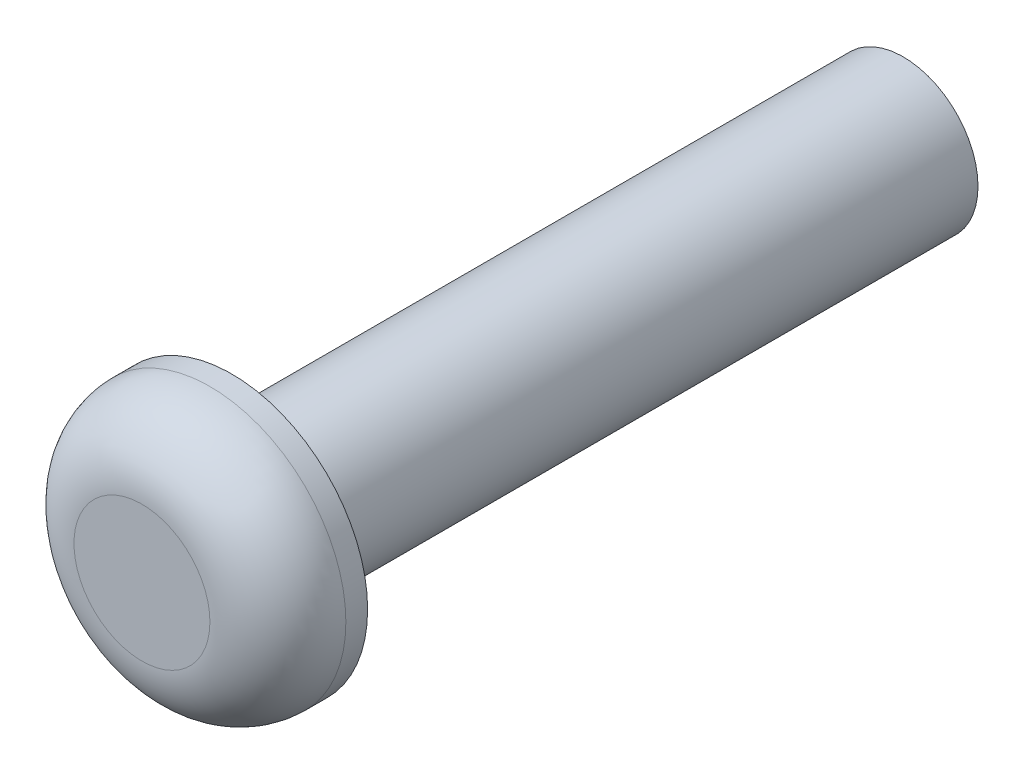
from build123d import *

# Parameters (mm, degrees)
SKETCH1_R           = 2.54
BOSS_EXTRUDE1_DEPTH = 1.6764
SKETCH3_R           = 1.397
BOSS_EXTRUDE2_DEPTH = 14.224
FILLET1_R           = 1.27


with BuildPart() as part:
    # Sketch1 → Boss-Extrude1 (new body)
    with BuildSketch(Plane.XY):
        Circle(SKETCH1_R)
    extrude(amount=BOSS_EXTRUDE1_DEPTH)

    # Sketch3 → Boss-Extrude2 (add)
    with BuildSketch(Plane.XY.offset(1.6764)):
        Circle(SKETCH3_R)
    extrude(amount=-BOSS_EXTRUDE2_DEPTH)

    # Fillet1
    fillet1_edges = [part.edges().sort_by_distance(p)[0] for p in [
        (-2.54, 0, 1.6764),
    ]]
    fillet(fillet1_edges, radius=FILLET1_R)


solid = part.part
